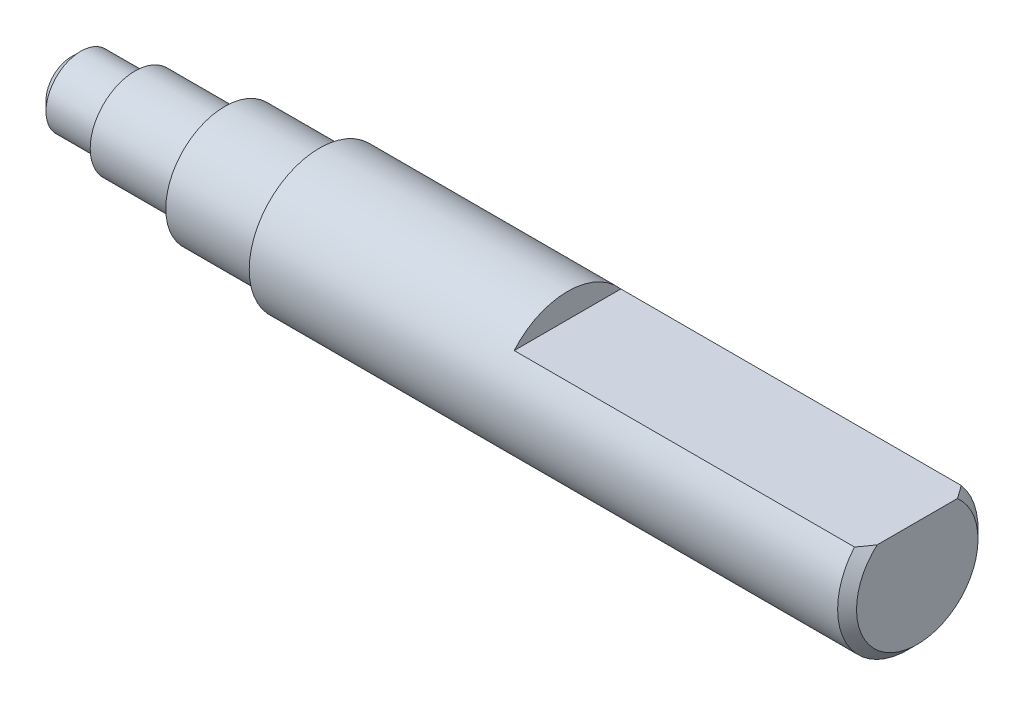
from build123d import *

# Parameters (mm, degrees)
CUT_EXTRUDE1_DEPTH = 7.4
CHAMFER1_SIZE      = 0.2


with BuildPart() as part:
    # Sketch1 → Revolve1 (revolve)
    with BuildSketch(Plane.XY, mode=Mode.PRIVATE) as revolve1_sk:
        Polygon((0, 0), (0, 0.735), (1.35, 0.735), (1.35, 0.95), (3.25, 0.95), (3.25, 1.25), (5.25, 1.25), (5.25, 1.485), (17.9, 1.485), (17.9, 0), align=None)
    revolve(revolve1_sk.sketch.rotate(Axis((-168.144085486, 0, 0), (1, 0, 0)), 90), axis=Axis((-168.144085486, 0, 0), (1, 0, 0)))

    # Sketch3 → Cut-Extrude1 (cut)
    with BuildSketch(Plane(origin=(17.9, 0, 0), x_dir=(0, 0, -1), z_dir=(1, 0, 0))):
        with BuildLine():
            Line((-1.128716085, 0.965), (1.128716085, 0.965))
            ThreePointArc((1.128716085, 0.965), (0, 1.485), (-1.128716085, 0.965))
        make_face()
    extrude(amount=-CUT_EXTRUDE1_DEPTH, mode=Mode.SUBTRACT)

    # Chamfer1
    chamfer1_edges = [part.edges().sort_by_distance(p)[0] for p in [
        (0, 0, -0.735),
        (17.9, -1.393084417, -0.514335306),
    ]]
    chamfer(chamfer1_edges, length=CHAMFER1_SIZE)


solid = part.part
